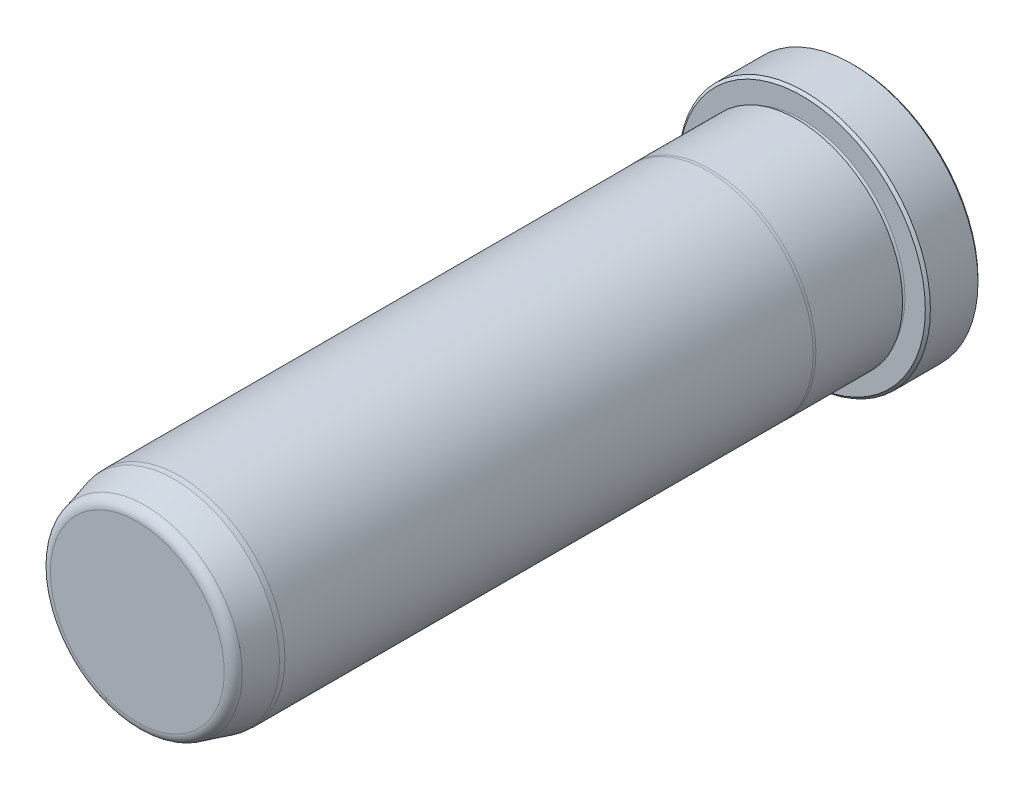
ISO-10303-21;
HEADER;
FILE_DESCRIPTION(('STEP AP214'),'2;1');
FILE_NAME('part.step','',(''),(''),'','','');
FILE_SCHEMA(('AUTOMOTIVE_DESIGN { 1 0 10303 214 1 1 1 1 }'));
ENDSEC;
DATA;
#1=APPLICATION_CONTEXT('core data for automotive mechanical design processes');
#2=APPLICATION_PROTOCOL_DEFINITION('international standard','automotive_design',2000,#1);
#3=PRODUCT_CONTEXT('',#1,'mechanical');
#4=PRODUCT('Part','Part','',(#3));
#5=PRODUCT_RELATED_PRODUCT_CATEGORY('part','',(#4));
#6=PRODUCT_DEFINITION_FORMATION('','',#4);
#7=PRODUCT_DEFINITION_CONTEXT('part definition',#1,'design');
#8=PRODUCT_DEFINITION('design','',#6,#7);
#9=PRODUCT_DEFINITION_SHAPE('','',#8);
#10=(LENGTH_UNIT() NAMED_UNIT(*) SI_UNIT(.MILLI.,.METRE.));
#11=(NAMED_UNIT(*) PLANE_ANGLE_UNIT() SI_UNIT($,.RADIAN.));
#12=(NAMED_UNIT(*) SI_UNIT($,.STERADIAN.) SOLID_ANGLE_UNIT());
#13=UNCERTAINTY_MEASURE_WITH_UNIT(LENGTH_MEASURE(1.E-05),#10,'distance_accuracy_value','');
#14=(GEOMETRIC_REPRESENTATION_CONTEXT(3) GLOBAL_UNCERTAINTY_ASSIGNED_CONTEXT((#13)) GLOBAL_UNIT_ASSIGNED_CONTEXT((#10,
#11,#12)) REPRESENTATION_CONTEXT('',''));
#15=CARTESIAN_POINT('',(0.,0.,0.));
#16=DIRECTION('',(0.,0.,1.));
#17=DIRECTION('',(1.,0.,0.));
#18=AXIS2_PLACEMENT_3D('',#15,#16,#17);
#19=CARTESIAN_POINT('',(0.,0.,0.));
#20=DIRECTION('',(0.,0.,1.));
#21=DIRECTION('',(1.,0.,0.));
#22=AXIS2_PLACEMENT_3D('',#19,#20,#21);
#23=PLANE('',#22);
#24=CARTESIAN_POINT('',(0.,0.,0.));
#25=DIRECTION('',(0.,0.,1.));
#26=DIRECTION('',(1.,0.,0.));
#27=AXIS2_PLACEMENT_3D('',#24,#25,#26);
#28=CIRCLE('',#27,18.542);
#29=CARTESIAN_POINT('',(18.542,0.,0.));
#30=VERTEX_POINT('',#29);
#31=EDGE_CURVE('E37',#30,#30,#28,.F.);
#32=ORIENTED_EDGE('',*,*,#31,.T.);
#33=EDGE_LOOP('',(#32));
#34=FACE_BOUND('',#33,.T.);
#35=ADVANCED_FACE('F30',(#34),#23,.F.);
#36=CARTESIAN_POINT('',(0.,0.,0.));
#37=DIRECTION('',(0.,0.,1.));
#38=DIRECTION('',(1.,0.,0.));
#39=AXIS2_PLACEMENT_3D('',#36,#37,#38);
#40=CYLINDRICAL_SURFACE('',#39,18.923);
#41=CARTESIAN_POINT('',(0.,0.,0.380999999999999));
#42=DIRECTION('',(0.,0.,1.));
#43=DIRECTION('',(1.,0.,0.));
#44=AXIS2_PLACEMENT_3D('',#41,#42,#43);
#45=CIRCLE('',#44,18.923);
#46=CARTESIAN_POINT('',(18.923,0.,0.380999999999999));
#47=VERTEX_POINT('',#46);
#48=EDGE_CURVE('E41',#47,#47,#45,.T.);
#49=ORIENTED_EDGE('',*,*,#48,.T.);
#50=EDGE_LOOP('',(#49));
#51=FACE_BOUND('',#50,.T.);
#52=CARTESIAN_POINT('',(0.,0.,7.54380000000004));
#53=DIRECTION('',(0.,0.,-1.));
#54=DIRECTION('',(-1.,0.,0.));
#55=AXIS2_PLACEMENT_3D('',#52,#53,#54);
#56=CIRCLE('',#55,18.923);
#57=CARTESIAN_POINT('',(-18.923,0.,7.54380000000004));
#58=VERTEX_POINT('',#57);
#59=EDGE_CURVE('E45',#58,#58,#56,.T.);
#60=ORIENTED_EDGE('',*,*,#59,.T.);
#61=EDGE_LOOP('',(#60));
#62=FACE_BOUND('',#61,.T.);
#63=ADVANCED_FACE('F118',(#51,#62),#40,.T.);
#64=CARTESIAN_POINT('',(0.,18.923,7.9248));
#65=DIRECTION('',(0.,0.,-1.));
#66=DIRECTION('',(-1.,0.,0.));
#67=AXIS2_PLACEMENT_3D('',#64,#65,#66);
#68=PLANE('',#67);
#69=CARTESIAN_POINT('',(0.,0.,7.9248));
#70=DIRECTION('',(0.,0.,-1.));
#71=DIRECTION('',(-1.,0.,0.));
#72=AXIS2_PLACEMENT_3D('',#69,#70,#71);
#73=CIRCLE('',#72,18.542);
#74=CARTESIAN_POINT('',(-18.542,0.,7.9248));
#75=VERTEX_POINT('',#74);
#76=EDGE_CURVE('E10',#75,#75,#73,.F.);
#77=ORIENTED_EDGE('',*,*,#76,.T.);
#78=EDGE_LOOP('',(#77));
#79=FACE_BOUND('',#78,.T.);
#80=CARTESIAN_POINT('',(0.,0.,7.9248));
#81=DIRECTION('',(0.,0.,1.));
#82=DIRECTION('',(1.,0.,0.));
#83=AXIS2_PLACEMENT_3D('',#80,#81,#82);
#84=CIRCLE('',#83,15.4813);
#85=CARTESIAN_POINT('',(15.4813,0.,7.9248));
#86=VERTEX_POINT('',#85);
#87=EDGE_CURVE('E56',#86,#86,#84,.T.);
#88=ORIENTED_EDGE('',*,*,#87,.F.);
#89=EDGE_LOOP('',(#88));
#90=FACE_BOUND('',#89,.T.);
#91=ADVANCED_FACE('F113',(#79,#90),#68,.F.);
#92=CARTESIAN_POINT('',(0.,0.,8.3058));
#93=DIRECTION('',(0.,0.,1.));
#94=DIRECTION('',(1.,0.,0.));
#95=AXIS2_PLACEMENT_3D('',#92,#93,#94);
#96=TOROIDAL_SURFACE('',#95,15.4813,0.381000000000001);
#97=CARTESIAN_POINT('',(0.,0.,8.6868));
#98=DIRECTION('',(0.,0.,1.));
#99=DIRECTION('',(1.,0.,0.));
#100=AXIS2_PLACEMENT_3D('',#97,#98,#99);
#101=CIRCLE('',#100,15.4813);
#102=CARTESIAN_POINT('',(15.4813,0.,8.6868));
#103=VERTEX_POINT('',#102);
#104=EDGE_CURVE('E59',#103,#103,#101,.T.);
#105=ORIENTED_EDGE('',*,*,#104,.F.);
#106=EDGE_LOOP('',(#105));
#107=FACE_BOUND('',#106,.T.);
#108=ORIENTED_EDGE('',*,*,#87,.T.);
#109=EDGE_LOOP('',(#108));
#110=FACE_BOUND('',#109,.T.);
#111=ADVANCED_FACE('F107',(#107,#110),#96,.F.);
#112=CARTESIAN_POINT('',(0.,15.4813,8.6868));
#113=DIRECTION('',(0.,0.,1.));
#114=DIRECTION('',(1.,0.,0.));
#115=AXIS2_PLACEMENT_3D('',#112,#113,#114);
#116=PLANE('',#115);
#117=CARTESIAN_POINT('',(0.,0.,8.6868));
#118=DIRECTION('',(0.,0.,1.));
#119=DIRECTION('',(1.,0.,0.));
#120=AXIS2_PLACEMENT_3D('',#117,#118,#119);
#121=CIRCLE('',#120,15.8877);
#122=CARTESIAN_POINT('',(15.8877,0.,8.6868));
#123=VERTEX_POINT('',#122);
#124=EDGE_CURVE('E62',#123,#123,#121,.T.);
#125=ORIENTED_EDGE('',*,*,#124,.F.);
#126=EDGE_LOOP('',(#125));
#127=FACE_BOUND('',#126,.T.);
#128=ORIENTED_EDGE('',*,*,#104,.T.);
#129=EDGE_LOOP('',(#128));
#130=FACE_BOUND('',#129,.T.);
#131=ADVANCED_FACE('F101',(#127,#130),#116,.F.);
#132=CARTESIAN_POINT('',(0.,0.,0.));
#133=DIRECTION('',(0.,0.,1.));
#134=DIRECTION('',(1.,0.,0.));
#135=AXIS2_PLACEMENT_3D('',#132,#133,#134);
#136=CYLINDRICAL_SURFACE('',#135,15.8877);
#137=CARTESIAN_POINT('',(0.,0.,21.7347630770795));
#138=DIRECTION('',(0.,0.,1.));
#139=DIRECTION('',(1.,0.,0.));
#140=AXIS2_PLACEMENT_3D('',#137,#138,#139);
#141=CIRCLE('',#140,15.8877);
#142=CARTESIAN_POINT('',(15.8877,0.,21.7347630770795));
#143=VERTEX_POINT('',#142);
#144=EDGE_CURVE('E65',#143,#143,#141,.T.);
#145=ORIENTED_EDGE('',*,*,#144,.F.);
#146=EDGE_LOOP('',(#145));
#147=FACE_BOUND('',#146,.T.);
#148=ORIENTED_EDGE('',*,*,#124,.T.);
#149=EDGE_LOOP('',(#148));
#150=FACE_BOUND('',#149,.T.);
#151=ADVANCED_FACE('F95',(#147,#150),#136,.T.);
#152=CARTESIAN_POINT('',(0.,0.,21.7347630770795));
#153=DIRECTION('',(0.,0.,-1.));
#154=DIRECTION('',(-1.,0.,0.));
#155=AXIS2_PLACEMENT_3D('',#152,#153,#154);
#156=CONICAL_SURFACE('',#155,15.8877,0.0698131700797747);
#157=CARTESIAN_POINT('',(0.,0.,22.098));
#158=DIRECTION('',(0.,0.,1.));
#159=DIRECTION('',(1.,0.,0.));
#160=AXIS2_PLACEMENT_3D('',#157,#158,#159);
#161=CIRCLE('',#160,15.8623);
#162=CARTESIAN_POINT('',(15.8623,0.,22.098));
#163=VERTEX_POINT('',#162);
#164=EDGE_CURVE('E68',#163,#163,#161,.T.);
#165=ORIENTED_EDGE('',*,*,#164,.F.);
#166=EDGE_LOOP('',(#165));
#167=FACE_BOUND('',#166,.T.);
#168=ORIENTED_EDGE('',*,*,#144,.T.);
#169=EDGE_LOOP('',(#168));
#170=FACE_BOUND('',#169,.T.);
#171=ADVANCED_FACE('F89',(#167,#170),#156,.T.);
#172=CARTESIAN_POINT('',(0.,0.,0.));
#173=DIRECTION('',(0.,0.,1.));
#174=DIRECTION('',(1.,0.,0.));
#175=AXIS2_PLACEMENT_3D('',#172,#173,#174);
#176=CYLINDRICAL_SURFACE('',#175,15.8623);
#177=CARTESIAN_POINT('',(0.,0.,101.6));
#178=DIRECTION('',(0.,0.,1.));
#179=DIRECTION('',(1.,0.,0.));
#180=AXIS2_PLACEMENT_3D('',#177,#178,#179);
#181=CIRCLE('',#180,15.8623);
#182=CARTESIAN_POINT('',(15.8623,0.,101.6));
#183=VERTEX_POINT('',#182);
#184=EDGE_CURVE('E71',#183,#183,#181,.T.);
#185=ORIENTED_EDGE('',*,*,#184,.F.);
#186=EDGE_LOOP('',(#185));
#187=FACE_BOUND('',#186,.T.);
#188=ORIENTED_EDGE('',*,*,#164,.T.);
#189=EDGE_LOOP('',(#188));
#190=FACE_BOUND('',#189,.T.);
#191=ADVANCED_FACE('F83',(#187,#190),#176,.T.);
#192=CARTESIAN_POINT('',(0.,0.,101.6));
#193=DIRECTION('',(0.,0.,-1.));
#194=DIRECTION('',(-1.,0.,0.));
#195=AXIS2_PLACEMENT_3D('',#192,#193,#194);
#196=CONICAL_SURFACE('',#195,15.8623,0.0872664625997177);
#197=CARTESIAN_POINT('',(0.,0.,102.362));
#198=DIRECTION('',(0.,0.,1.));
#199=DIRECTION('',(1.,0.,0.));
#200=AXIS2_PLACEMENT_3D('',#197,#198,#199);
#201=CIRCLE('',#200,15.7956336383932);
#202=CARTESIAN_POINT('',(15.7956336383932,0.,102.362));
#203=VERTEX_POINT('',#202);
#204=EDGE_CURVE('E74',#203,#203,#201,.T.);
#205=ORIENTED_EDGE('',*,*,#204,.F.);
#206=EDGE_LOOP('',(#205));
#207=FACE_BOUND('',#206,.T.);
#208=ORIENTED_EDGE('',*,*,#184,.T.);
#209=EDGE_LOOP('',(#208));
#210=FACE_BOUND('',#209,.T.);
#211=ADVANCED_FACE('F80',(#207,#210),#196,.T.);
#212=CARTESIAN_POINT('',(0.,0.,102.362));
#213=DIRECTION('',(0.,0.,-1.));
#214=DIRECTION('',(-1.,0.,0.));
#215=AXIS2_PLACEMENT_3D('',#212,#213,#214);
#216=CONICAL_SURFACE('',#215,15.7956336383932,0.261799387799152);
#217=CARTESIAN_POINT('',(0.,0.,106.7733752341));
#218=DIRECTION('',(0.,0.,1.));
#219=DIRECTION('',(1.,0.,0.));
#220=AXIS2_PLACEMENT_3D('',#217,#218,#219);
#221=CIRCLE('',#220,14.6136092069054);
#222=CARTESIAN_POINT('',(14.6136092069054,0.,106.7733752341));
#223=VERTEX_POINT('',#222);
#224=EDGE_CURVE('E50',#223,#223,#221,.F.);
#225=ORIENTED_EDGE('',*,*,#224,.T.);
#226=EDGE_LOOP('',(#225));
#227=FACE_BOUND('',#226,.T.);
#228=ORIENTED_EDGE('',*,*,#204,.T.);
#229=EDGE_LOOP('',(#228));
#230=FACE_BOUND('',#229,.T.);
#231=ADVANCED_FACE('F78',(#227,#230),#216,.T.);
#232=CARTESIAN_POINT('',(0.,14.2983335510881,107.95));
#233=DIRECTION('',(0.,0.,-1.));
#234=DIRECTION('',(-1.,0.,0.));
#235=AXIS2_PLACEMENT_3D('',#232,#233,#234);
#236=PLANE('',#235);
#237=CARTESIAN_POINT('',(0.,0.,107.95));
#238=DIRECTION('',(0.,0.,-1.));
#239=DIRECTION('',(-1.,0.,0.));
#240=AXIS2_PLACEMENT_3D('',#237,#238,#239);
#241=CIRCLE('',#240,13.0802019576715);
#242=CARTESIAN_POINT('',(-13.0802019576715,0.,107.95));
#243=VERTEX_POINT('',#242);
#244=EDGE_CURVE('E53',#243,#243,#241,.F.);
#245=ORIENTED_EDGE('',*,*,#244,.T.);
#246=EDGE_LOOP('',(#245));
#247=FACE_BOUND('',#246,.T.);
#248=ADVANCED_FACE('F133',(#247),#236,.F.);
#249=CARTESIAN_POINT('',(0.,0.,106.3625));
#250=DIRECTION('',(0.,0.,-1.));
#251=DIRECTION('',(-1.,0.,0.));
#252=AXIS2_PLACEMENT_3D('',#249,#250,#251);
#253=TOROIDAL_SURFACE('',#252,13.0802019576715,1.5875);
#254=ORIENTED_EDGE('',*,*,#224,.F.);
#255=EDGE_LOOP('',(#254));
#256=FACE_BOUND('',#255,.T.);
#257=ORIENTED_EDGE('',*,*,#244,.F.);
#258=EDGE_LOOP('',(#257));
#259=FACE_BOUND('',#258,.T.);
#260=ADVANCED_FACE('F130',(#256,#259),#253,.T.);
#261=CARTESIAN_POINT('',(0.,0.,0.380999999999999));
#262=DIRECTION('',(0.,0.,1.));
#263=DIRECTION('',(1.,0.,0.));
#264=AXIS2_PLACEMENT_3D('',#261,#262,#263);
#265=CONICAL_SURFACE('',#264,18.923,0.785398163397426);
#266=ORIENTED_EDGE('',*,*,#31,.F.);
#267=EDGE_LOOP('',(#266));
#268=FACE_BOUND('',#267,.T.);
#269=ORIENTED_EDGE('',*,*,#48,.F.);
#270=EDGE_LOOP('',(#269));
#271=FACE_BOUND('',#270,.T.);
#272=ADVANCED_FACE('F132',(#268,#271),#265,.T.);
#273=CARTESIAN_POINT('',(0.,0.,7.9248));
#274=DIRECTION('',(0.,0.,-1.));
#275=DIRECTION('',(-1.,0.,0.));
#276=AXIS2_PLACEMENT_3D('',#273,#274,#275);
#277=CONICAL_SURFACE('',#276,18.542,0.785398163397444);
#278=ORIENTED_EDGE('',*,*,#59,.F.);
#279=EDGE_LOOP('',(#278));
#280=FACE_BOUND('',#279,.T.);
#281=ORIENTED_EDGE('',*,*,#76,.F.);
#282=EDGE_LOOP('',(#281));
#283=FACE_BOUND('',#282,.T.);
#284=ADVANCED_FACE('F32',(#280,#283),#277,.T.);
#285=CLOSED_SHELL('',(#35,#63,#91,#111,#131,#151,#171,#191,#211,#231,#248,#260,#272,#284));
#286=MANIFOLD_SOLID_BREP('B2',#285);
#287=ADVANCED_BREP_SHAPE_REPRESENTATION('',(#18,#286),#14);
#288=SHAPE_DEFINITION_REPRESENTATION(#9,#287);
ENDSEC;
END-ISO-10303-21;
